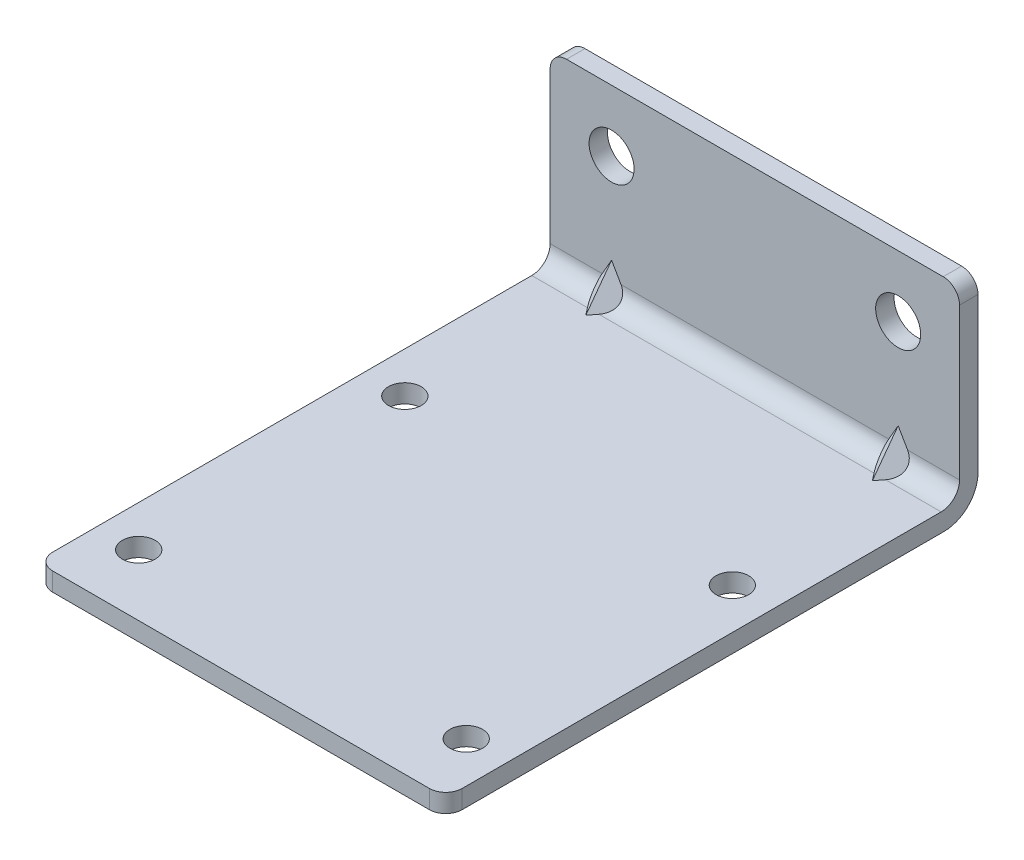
ISO-10303-21;
HEADER;
FILE_DESCRIPTION(('STEP AP214'),'2;1');
FILE_NAME('part.step','',(''),(''),'','','');
FILE_SCHEMA(('AUTOMOTIVE_DESIGN { 1 0 10303 214 1 1 1 1 }'));
ENDSEC;
DATA;
#1=APPLICATION_CONTEXT('core data for automotive mechanical design processes');
#2=APPLICATION_PROTOCOL_DEFINITION('international standard','automotive_design',2000,#1);
#3=PRODUCT_CONTEXT('',#1,'mechanical');
#4=PRODUCT('Part','Part','',(#3));
#5=PRODUCT_RELATED_PRODUCT_CATEGORY('part','',(#4));
#6=PRODUCT_DEFINITION_FORMATION('','',#4);
#7=PRODUCT_DEFINITION_CONTEXT('part definition',#1,'design');
#8=PRODUCT_DEFINITION('design','',#6,#7);
#9=PRODUCT_DEFINITION_SHAPE('','',#8);
#10=(LENGTH_UNIT() NAMED_UNIT(*) SI_UNIT(.MILLI.,.METRE.));
#11=(NAMED_UNIT(*) PLANE_ANGLE_UNIT() SI_UNIT($,.RADIAN.));
#12=(NAMED_UNIT(*) SI_UNIT($,.STERADIAN.) SOLID_ANGLE_UNIT());
#13=UNCERTAINTY_MEASURE_WITH_UNIT(LENGTH_MEASURE(1.E-05),#10,'distance_accuracy_value','');
#14=(GEOMETRIC_REPRESENTATION_CONTEXT(3) GLOBAL_UNCERTAINTY_ASSIGNED_CONTEXT((#13)) GLOBAL_UNIT_ASSIGNED_CONTEXT((#10,
#11,#12)) REPRESENTATION_CONTEXT('',''));
#15=CARTESIAN_POINT('',(0.,0.,0.));
#16=DIRECTION('',(0.,0.,1.));
#17=DIRECTION('',(1.,0.,0.));
#18=AXIS2_PLACEMENT_3D('',#15,#16,#17);
#19=CARTESIAN_POINT('',(-15.,-35.,130.));
#20=DIRECTION('',(0.,-1.,0.));
#21=DIRECTION('',(0.,0.,1.));
#22=AXIS2_PLACEMENT_3D('',#19,#20,#21);
#23=PLANE('',#22);
#24=CARTESIAN_POINT('',(75.,-35.,50.));
#25=DIRECTION('',(0.,-1.,0.));
#26=DIRECTION('',(1.,0.,0.));
#27=AXIS2_PLACEMENT_3D('',#24,#25,#26);
#28=CIRCLE('',#27,4.);
#29=CARTESIAN_POINT('',(79.,-35.,50.));
#30=VERTEX_POINT('',#29);
#31=EDGE_CURVE('E254',#30,#30,#28,.T.);
#32=ORIENTED_EDGE('',*,*,#31,.F.);
#33=EDGE_LOOP('',(#32));
#34=FACE_BOUND('',#33,.T.);
#35=CARTESIAN_POINT('',(-5.,-35.,50.));
#36=DIRECTION('',(0.,1.,0.));
#37=DIRECTION('',(-1.,0.,0.));
#38=AXIS2_PLACEMENT_3D('',#35,#36,#37);
#39=CIRCLE('',#38,4.);
#40=CARTESIAN_POINT('',(-9.,-35.,50.));
#41=VERTEX_POINT('',#40);
#42=EDGE_CURVE('E260',#41,#41,#39,.T.);
#43=ORIENTED_EDGE('',*,*,#42,.T.);
#44=EDGE_LOOP('',(#43));
#45=FACE_BOUND('',#44,.T.);
#46=CARTESIAN_POINT('',(-5.,-35.,115.));
#47=DIRECTION('',(0.,1.,0.));
#48=DIRECTION('',(-1.,0.,0.));
#49=AXIS2_PLACEMENT_3D('',#46,#47,#48);
#50=CIRCLE('',#49,4.);
#51=CARTESIAN_POINT('',(-9.,-35.,115.));
#52=VERTEX_POINT('',#51);
#53=EDGE_CURVE('E266',#52,#52,#50,.T.);
#54=ORIENTED_EDGE('',*,*,#53,.T.);
#55=EDGE_LOOP('',(#54));
#56=FACE_BOUND('',#55,.T.);
#57=CARTESIAN_POINT('',(75.,-35.,115.));
#58=DIRECTION('',(0.,-1.,0.));
#59=DIRECTION('',(1.,0.,0.));
#60=AXIS2_PLACEMENT_3D('',#57,#58,#59);
#61=CIRCLE('',#60,4.);
#62=CARTESIAN_POINT('',(79.,-35.,115.));
#63=VERTEX_POINT('',#62);
#64=EDGE_CURVE('E248',#63,#63,#61,.T.);
#65=ORIENTED_EDGE('',*,*,#64,.F.);
#66=EDGE_LOOP('',(#65));
#67=FACE_BOUND('',#66,.T.);
#68=DIRECTION('',(-0.614470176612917,0.,0.788940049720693));
#69=VECTOR('',#68,1.);
#70=CARTESIAN_POINT('',(-64.6392494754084,-35.,91.3382050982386));
#71=LINE('',#70,#69);
#72=CARTESIAN_POINT('',(0.035500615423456,-35.,8.3));
#73=VERTEX_POINT('',#72);
#74=CARTESIAN_POINT('',(0.,-35.,8.34558049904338));
#75=VERTEX_POINT('',#74);
#76=EDGE_CURVE('E212',#73,#75,#71,.T.);
#77=ORIENTED_EDGE('',*,*,#76,.F.);
#78=DIRECTION('',(1.,0.,0.));
#79=VECTOR('',#78,1.);
#80=CARTESIAN_POINT('',(-15.,-35.,8.3));
#81=LINE('',#80,#79);
#82=CARTESIAN_POINT('',(69.9644993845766,-35.,8.3));
#83=VERTEX_POINT('',#82);
#84=EDGE_CURVE('E193',#73,#83,#81,.T.);
#85=ORIENTED_EDGE('',*,*,#84,.T.);
#86=DIRECTION('',(-0.614470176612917,0.,-0.788940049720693));
#87=VECTOR('',#86,1.);
#88=CARTESIAN_POINT('',(96.8818896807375,-35.,42.8601919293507));
#89=LINE('',#88,#87);
#90=CARTESIAN_POINT('',(70.,-35.,8.34558049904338));
#91=VERTEX_POINT('',#90);
#92=EDGE_CURVE('E187',#83,#91,#89,.F.);
#93=ORIENTED_EDGE('',*,*,#92,.T.);
#94=DIRECTION('',(-0.614470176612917,0.,0.788940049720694));
#95=VECTOR('',#94,1.);
#96=CARTESIAN_POINT('',(-21.0694013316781,-35.,125.27281431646));
#97=LINE('',#96,#95);
#98=CARTESIAN_POINT('',(70.0355006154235,-35.,8.3));
#99=VERTEX_POINT('',#98);
#100=EDGE_CURVE('E175',#99,#91,#97,.T.);
#101=ORIENTED_EDGE('',*,*,#100,.F.);
#102=DIRECTION('',(1.,0.,0.));
#103=VECTOR('',#102,1.);
#104=CARTESIAN_POINT('',(-15.,-35.,8.3));
#105=LINE('',#104,#103);
#106=CARTESIAN_POINT('',(85.,-35.,8.3));
#107=VERTEX_POINT('',#106);
#108=EDGE_CURVE('E381',#99,#107,#105,.T.);
#109=ORIENTED_EDGE('',*,*,#108,.T.);
#110=DIRECTION('',(0.,0.,-1.));
#111=VECTOR('',#110,1.);
#112=CARTESIAN_POINT('',(85.,-35.,130.));
#113=LINE('',#112,#111);
#114=CARTESIAN_POINT('',(85.,-35.,126.));
#115=VERTEX_POINT('',#114);
#116=EDGE_CURVE('E283',#115,#107,#113,.T.);
#117=ORIENTED_EDGE('',*,*,#116,.F.);
#118=CARTESIAN_POINT('',(81.,-35.,126.));
#119=DIRECTION('',(0.,-1.,0.));
#120=DIRECTION('',(0.,0.,1.));
#121=AXIS2_PLACEMENT_3D('',#118,#119,#120);
#122=CIRCLE('',#121,4.);
#123=CARTESIAN_POINT('',(81.,-35.,130.));
#124=VERTEX_POINT('',#123);
#125=EDGE_CURVE('E338',#115,#124,#122,.T.);
#126=ORIENTED_EDGE('',*,*,#125,.T.);
#127=DIRECTION('',(1.,0.,0.));
#128=VECTOR('',#127,1.);
#129=CARTESIAN_POINT('',(-15.,-35.,130.));
#130=LINE('',#129,#128);
#131=CARTESIAN_POINT('',(-11.,-35.,130.));
#132=VERTEX_POINT('',#131);
#133=EDGE_CURVE('E306',#132,#124,#130,.T.);
#134=ORIENTED_EDGE('',*,*,#133,.F.);
#135=CARTESIAN_POINT('',(-11.,-35.,126.));
#136=DIRECTION('',(0.,-1.,0.));
#137=DIRECTION('',(0.,0.,1.));
#138=AXIS2_PLACEMENT_3D('',#135,#136,#137);
#139=CIRCLE('',#138,4.);
#140=CARTESIAN_POINT('',(-15.,-35.,126.));
#141=VERTEX_POINT('',#140);
#142=EDGE_CURVE('E336',#132,#141,#139,.T.);
#143=ORIENTED_EDGE('',*,*,#142,.T.);
#144=DIRECTION('',(0.,0.,-1.));
#145=VECTOR('',#144,1.);
#146=CARTESIAN_POINT('',(-15.,-35.,130.));
#147=LINE('',#146,#145);
#148=CARTESIAN_POINT('',(-15.,-35.,8.3));
#149=VERTEX_POINT('',#148);
#150=EDGE_CURVE('E292',#141,#149,#147,.T.);
#151=ORIENTED_EDGE('',*,*,#150,.T.);
#152=DIRECTION('',(1.,0.,0.));
#153=VECTOR('',#152,1.);
#154=CARTESIAN_POINT('',(-15.,-35.,8.3));
#155=LINE('',#154,#153);
#156=CARTESIAN_POINT('',(-0.0355006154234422,-35.,8.3));
#157=VERTEX_POINT('',#156);
#158=EDGE_CURVE('E378',#149,#157,#155,.T.);
#159=ORIENTED_EDGE('',*,*,#158,.T.);
#160=DIRECTION('',(-0.614470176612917,0.,-0.788940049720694));
#161=VECTOR('',#160,1.);
#162=CARTESIAN_POINT('',(53.3120415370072,-35.,76.7948011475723));
#163=LINE('',#162,#161);
#164=EDGE_CURVE('E214',#157,#75,#163,.F.);
#165=ORIENTED_EDGE('',*,*,#164,.T.);
#166=EDGE_LOOP('',(#77,#85,#93,#101,#109,#117,#126,#134,#143,#151,#159,#165));
#167=FACE_BOUND('',#166,.T.);
#168=ADVANCED_FACE('F14',(#34,#45,#56,#67,#167),#23,.T.);
#169=CARTESIAN_POINT('',(-15.,-35.,0.));
#170=DIRECTION('',(0.,0.,-1.));
#171=DIRECTION('',(0.,-1.,0.));
#172=AXIS2_PLACEMENT_3D('',#169,#170,#171);
#173=PLANE('',#172);
#174=CARTESIAN_POINT('',(70.,0.,0.));
#175=DIRECTION('',(0.,0.,1.));
#176=DIRECTION('',(0.,1.,0.));
#177=AXIS2_PLACEMENT_3D('',#174,#175,#176);
#178=CIRCLE('',#177,5.5);
#179=CARTESIAN_POINT('',(70.,5.5,0.));
#180=VERTEX_POINT('',#179);
#181=EDGE_CURVE('E278',#180,#180,#178,.T.);
#182=ORIENTED_EDGE('',*,*,#181,.T.);
#183=EDGE_LOOP('',(#182));
#184=FACE_BOUND('',#183,.T.);
#185=CARTESIAN_POINT('',(0.,0.,0.));
#186=DIRECTION('',(0.,0.,-1.));
#187=DIRECTION('',(0.,-1.,0.));
#188=AXIS2_PLACEMENT_3D('',#185,#186,#187);
#189=CIRCLE('',#188,5.5);
#190=CARTESIAN_POINT('',(0.,-5.5,0.));
#191=VERTEX_POINT('',#190);
#192=EDGE_CURVE('E272',#191,#191,#189,.T.);
#193=ORIENTED_EDGE('',*,*,#192,.F.);
#194=EDGE_LOOP('',(#193));
#195=FACE_BOUND('',#194,.T.);
#196=DIRECTION('',(-0.5,-0.866025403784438,0.));
#197=VECTOR('',#196,1.);
#198=CARTESIAN_POINT('',(70.,-23.7416697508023,0.));
#199=LINE('',#198,#197);
#200=CARTESIAN_POINT('',(70.,-23.7416697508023,0.));
#201=VERTEX_POINT('',#200);
#202=CARTESIAN_POINT('',(68.2920072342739,-26.7,0.));
#203=VERTEX_POINT('',#202);
#204=EDGE_CURVE('E199',#201,#203,#199,.T.);
#205=ORIENTED_EDGE('',*,*,#204,.T.);
#206=DIRECTION('',(1.,0.,0.));
#207=VECTOR('',#206,1.);
#208=CARTESIAN_POINT('',(-15.,-26.7,0.));
#209=LINE('',#208,#207);
#210=CARTESIAN_POINT('',(1.7079927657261,-26.7,0.));
#211=VERTEX_POINT('',#210);
#212=EDGE_CURVE('E389',#203,#211,#209,.F.);
#213=ORIENTED_EDGE('',*,*,#212,.T.);
#214=DIRECTION('',(0.5,-0.866025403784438,0.));
#215=VECTOR('',#214,1.);
#216=CARTESIAN_POINT('',(0.,-23.7416697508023,0.));
#217=LINE('',#216,#215);
#218=CARTESIAN_POINT('',(0.,-23.7416697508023,0.));
#219=VERTEX_POINT('',#218);
#220=EDGE_CURVE('E206',#219,#211,#217,.T.);
#221=ORIENTED_EDGE('',*,*,#220,.F.);
#222=DIRECTION('',(-0.5,-0.866025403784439,0.));
#223=VECTOR('',#222,1.);
#224=CARTESIAN_POINT('',(0.,-23.7416697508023,0.));
#225=LINE('',#224,#223);
#226=CARTESIAN_POINT('',(-1.70799276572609,-26.7,0.));
#227=VERTEX_POINT('',#226);
#228=EDGE_CURVE('E195',#219,#227,#225,.T.);
#229=ORIENTED_EDGE('',*,*,#228,.T.);
#230=DIRECTION('',(1.,0.,0.));
#231=VECTOR('',#230,1.);
#232=CARTESIAN_POINT('',(-15.,-26.7,0.));
#233=LINE('',#232,#231);
#234=CARTESIAN_POINT('',(-15.,-26.7,0.));
#235=VERTEX_POINT('',#234);
#236=EDGE_CURVE('E37',#227,#235,#233,.F.);
#237=ORIENTED_EDGE('',*,*,#236,.T.);
#238=DIRECTION('',(0.,1.,0.));
#239=VECTOR('',#238,1.);
#240=CARTESIAN_POINT('',(-15.,-35.,0.));
#241=LINE('',#240,#239);
#242=CARTESIAN_POINT('',(-15.,11.,0.));
#243=VERTEX_POINT('',#242);
#244=EDGE_CURVE('E290',#235,#243,#241,.T.);
#245=ORIENTED_EDGE('',*,*,#244,.T.);
#246=CARTESIAN_POINT('',(-11.,11.,0.));
#247=DIRECTION('',(0.,0.,-1.));
#248=DIRECTION('',(0.,-1.,0.));
#249=AXIS2_PLACEMENT_3D('',#246,#247,#248);
#250=CIRCLE('',#249,4.);
#251=CARTESIAN_POINT('',(-11.,15.,0.));
#252=VERTEX_POINT('',#251);
#253=EDGE_CURVE('E318',#243,#252,#250,.T.);
#254=ORIENTED_EDGE('',*,*,#253,.T.);
#255=DIRECTION('',(1.,0.,0.));
#256=VECTOR('',#255,1.);
#257=CARTESIAN_POINT('',(-15.,15.,0.));
#258=LINE('',#257,#256);
#259=CARTESIAN_POINT('',(81.,15.,0.));
#260=VERTEX_POINT('',#259);
#261=EDGE_CURVE('E309',#252,#260,#258,.T.);
#262=ORIENTED_EDGE('',*,*,#261,.T.);
#263=CARTESIAN_POINT('',(81.,11.,0.));
#264=DIRECTION('',(0.,0.,-1.));
#265=DIRECTION('',(0.,-1.,0.));
#266=AXIS2_PLACEMENT_3D('',#263,#264,#265);
#267=CIRCLE('',#266,4.);
#268=CARTESIAN_POINT('',(85.,11.,0.));
#269=VERTEX_POINT('',#268);
#270=EDGE_CURVE('E315',#260,#269,#267,.T.);
#271=ORIENTED_EDGE('',*,*,#270,.T.);
#272=DIRECTION('',(0.,1.,0.));
#273=VECTOR('',#272,1.);
#274=CARTESIAN_POINT('',(85.,-35.,0.));
#275=LINE('',#274,#273);
#276=CARTESIAN_POINT('',(85.,-26.7,0.));
#277=VERTEX_POINT('',#276);
#278=EDGE_CURVE('E281',#277,#269,#275,.T.);
#279=ORIENTED_EDGE('',*,*,#278,.F.);
#280=DIRECTION('',(1.,0.,0.));
#281=VECTOR('',#280,1.);
#282=CARTESIAN_POINT('',(-15.,-26.7,0.));
#283=LINE('',#282,#281);
#284=CARTESIAN_POINT('',(71.7079927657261,-26.7,0.));
#285=VERTEX_POINT('',#284);
#286=EDGE_CURVE('E387',#277,#285,#283,.F.);
#287=ORIENTED_EDGE('',*,*,#286,.T.);
#288=DIRECTION('',(0.5,-0.866025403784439,0.));
#289=VECTOR('',#288,1.);
#290=CARTESIAN_POINT('',(70.,-23.7416697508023,0.));
#291=LINE('',#290,#289);
#292=EDGE_CURVE('E200',#201,#285,#291,.T.);
#293=ORIENTED_EDGE('',*,*,#292,.F.);
#294=EDGE_LOOP('',(#205,#213,#221,#229,#237,#245,#254,#262,#271,#279,#287,#293));
#295=FACE_BOUND('',#294,.T.);
#296=ADVANCED_FACE('F16',(#184,#195,#295),#173,.T.);
#297=CARTESIAN_POINT('',(-15.,-30.5,130.));
#298=DIRECTION('',(0.,-1.,0.));
#299=DIRECTION('',(0.,0.,1.));
#300=AXIS2_PLACEMENT_3D('',#297,#298,#299);
#301=PLANE('',#300);
#302=CARTESIAN_POINT('',(75.,-30.5,115.));
#303=DIRECTION('',(0.,-1.,0.));
#304=DIRECTION('',(1.,0.,0.));
#305=AXIS2_PLACEMENT_3D('',#302,#303,#304);
#306=CIRCLE('',#305,4.);
#307=CARTESIAN_POINT('',(79.,-30.5,115.));
#308=VERTEX_POINT('',#307);
#309=EDGE_CURVE('E245',#308,#308,#306,.T.);
#310=ORIENTED_EDGE('',*,*,#309,.T.);
#311=EDGE_LOOP('',(#310));
#312=FACE_BOUND('',#311,.T.);
#313=CARTESIAN_POINT('',(-5.,-30.5,115.));
#314=DIRECTION('',(0.,1.,0.));
#315=DIRECTION('',(-1.,0.,0.));
#316=AXIS2_PLACEMENT_3D('',#313,#314,#315);
#317=CIRCLE('',#316,4.);
#318=CARTESIAN_POINT('',(-9.,-30.5,115.));
#319=VERTEX_POINT('',#318);
#320=EDGE_CURVE('E263',#319,#319,#317,.T.);
#321=ORIENTED_EDGE('',*,*,#320,.F.);
#322=EDGE_LOOP('',(#321));
#323=FACE_BOUND('',#322,.T.);
#324=CARTESIAN_POINT('',(-5.,-30.5,50.));
#325=DIRECTION('',(0.,1.,0.));
#326=DIRECTION('',(-1.,0.,0.));
#327=AXIS2_PLACEMENT_3D('',#324,#325,#326);
#328=CIRCLE('',#327,4.);
#329=CARTESIAN_POINT('',(-9.,-30.5,50.));
#330=VERTEX_POINT('',#329);
#331=EDGE_CURVE('E257',#330,#330,#328,.T.);
#332=ORIENTED_EDGE('',*,*,#331,.F.);
#333=EDGE_LOOP('',(#332));
#334=FACE_BOUND('',#333,.T.);
#335=CARTESIAN_POINT('',(75.,-30.5,50.));
#336=DIRECTION('',(0.,-1.,0.));
#337=DIRECTION('',(1.,0.,0.));
#338=AXIS2_PLACEMENT_3D('',#335,#336,#337);
#339=CIRCLE('',#338,4.);
#340=CARTESIAN_POINT('',(79.,-30.5,50.));
#341=VERTEX_POINT('',#340);
#342=EDGE_CURVE('E251',#341,#341,#339,.T.);
#343=ORIENTED_EDGE('',*,*,#342,.T.);
#344=EDGE_LOOP('',(#343));
#345=FACE_BOUND('',#344,.T.);
#346=DIRECTION('',(-0.614470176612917,0.,-0.788940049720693));
#347=VECTOR('',#346,1.);
#348=CARTESIAN_POINT('',(95.6950639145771,-30.5,43.7845575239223));
#349=LINE('',#348,#347);
#350=CARTESIAN_POINT('',(70.,-30.5,10.793753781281));
#351=VERTEX_POINT('',#350);
#352=CARTESIAN_POINT('',(68.6029252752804,-30.5,9.));
#353=VERTEX_POINT('',#352);
#354=EDGE_CURVE('E228',#351,#353,#349,.T.);
#355=ORIENTED_EDGE('',*,*,#354,.T.);
#356=DIRECTION('',(1.,0.,0.));
#357=VECTOR('',#356,1.);
#358=CARTESIAN_POINT('',(-15.,-30.5,9.));
#359=LINE('',#358,#357);
#360=CARTESIAN_POINT('',(1.3970747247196,-30.5,9.));
#361=VERTEX_POINT('',#360);
#362=EDGE_CURVE('E366',#353,#361,#359,.F.);
#363=ORIENTED_EDGE('',*,*,#362,.T.);
#364=DIRECTION('',(-0.614470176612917,0.,0.788940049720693));
#365=VECTOR('',#364,1.);
#366=CARTESIAN_POINT('',(-63.4524237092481,-30.5,92.2625706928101));
#367=LINE('',#366,#365);
#368=CARTESIAN_POINT('',(0.,-30.5,10.793753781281));
#369=VERTEX_POINT('',#368);
#370=EDGE_CURVE('E242',#369,#361,#367,.F.);
#371=ORIENTED_EDGE('',*,*,#370,.F.);
#372=DIRECTION('',(-0.614470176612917,0.,-0.788940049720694));
#373=VECTOR('',#372,1.);
#374=CARTESIAN_POINT('',(52.1252157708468,-30.5,77.7191667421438));
#375=LINE('',#374,#373);
#376=CARTESIAN_POINT('',(-1.39707472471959,-30.5,9.));
#377=VERTEX_POINT('',#376);
#378=EDGE_CURVE('E239',#369,#377,#375,.T.);
#379=ORIENTED_EDGE('',*,*,#378,.T.);
#380=DIRECTION('',(1.,0.,0.));
#381=VECTOR('',#380,1.);
#382=CARTESIAN_POINT('',(-15.,-30.5,9.));
#383=LINE('',#382,#381);
#384=CARTESIAN_POINT('',(-15.,-30.5,9.));
#385=VERTEX_POINT('',#384);
#386=EDGE_CURVE('E362',#377,#385,#383,.F.);
#387=ORIENTED_EDGE('',*,*,#386,.T.);
#388=DIRECTION('',(0.,0.,-1.));
#389=VECTOR('',#388,1.);
#390=CARTESIAN_POINT('',(-15.,-30.5,130.));
#391=LINE('',#390,#389);
#392=CARTESIAN_POINT('',(-15.,-30.5,126.));
#393=VERTEX_POINT('',#392);
#394=EDGE_CURVE('E295',#393,#385,#391,.T.);
#395=ORIENTED_EDGE('',*,*,#394,.F.);
#396=CARTESIAN_POINT('',(-11.,-30.5,126.));
#397=DIRECTION('',(0.,-1.,0.));
#398=DIRECTION('',(0.,0.,1.));
#399=AXIS2_PLACEMENT_3D('',#396,#397,#398);
#400=CIRCLE('',#399,4.);
#401=CARTESIAN_POINT('',(-11.,-30.5,130.));
#402=VERTEX_POINT('',#401);
#403=EDGE_CURVE('E345',#393,#402,#400,.F.);
#404=ORIENTED_EDGE('',*,*,#403,.T.);
#405=DIRECTION('',(1.,0.,0.));
#406=VECTOR('',#405,1.);
#407=CARTESIAN_POINT('',(-15.,-30.5,130.));
#408=LINE('',#407,#406);
#409=CARTESIAN_POINT('',(81.,-30.5,130.));
#410=VERTEX_POINT('',#409);
#411=EDGE_CURVE('E303',#402,#410,#408,.T.);
#412=ORIENTED_EDGE('',*,*,#411,.T.);
#413=CARTESIAN_POINT('',(81.,-30.5,126.));
#414=DIRECTION('',(0.,-1.,0.));
#415=DIRECTION('',(0.,0.,1.));
#416=AXIS2_PLACEMENT_3D('',#413,#414,#415);
#417=CIRCLE('',#416,4.);
#418=CARTESIAN_POINT('',(85.,-30.5,126.));
#419=VERTEX_POINT('',#418);
#420=EDGE_CURVE('E347',#410,#419,#417,.F.);
#421=ORIENTED_EDGE('',*,*,#420,.T.);
#422=DIRECTION('',(0.,0.,-1.));
#423=VECTOR('',#422,1.);
#424=CARTESIAN_POINT('',(85.,-30.5,130.));
#425=LINE('',#424,#423);
#426=CARTESIAN_POINT('',(85.,-30.5,9.));
#427=VERTEX_POINT('',#426);
#428=EDGE_CURVE('E285',#419,#427,#425,.T.);
#429=ORIENTED_EDGE('',*,*,#428,.T.);
#430=DIRECTION('',(1.,0.,0.));
#431=VECTOR('',#430,1.);
#432=CARTESIAN_POINT('',(-15.,-30.5,9.));
#433=LINE('',#432,#431);
#434=CARTESIAN_POINT('',(71.3970747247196,-30.5,9.));
#435=VERTEX_POINT('',#434);
#436=EDGE_CURVE('E364',#427,#435,#433,.F.);
#437=ORIENTED_EDGE('',*,*,#436,.T.);
#438=DIRECTION('',(-0.614470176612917,0.,0.788940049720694));
#439=VECTOR('',#438,1.);
#440=CARTESIAN_POINT('',(-19.8825755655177,-30.5,126.197179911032));
#441=LINE('',#440,#439);
#442=EDGE_CURVE('E225',#351,#435,#441,.F.);
#443=ORIENTED_EDGE('',*,*,#442,.F.);
#444=EDGE_LOOP('',(#355,#363,#371,#379,#387,#395,#404,#412,#421,#429,#437,#443));
#445=FACE_BOUND('',#444,.T.);
#446=ADVANCED_FACE('F418',(#312,#323,#334,#345,#445),#301,.F.);
#447=CARTESIAN_POINT('',(-15.,-35.,4.5));
#448=DIRECTION('',(0.,0.,-1.));
#449=DIRECTION('',(0.,-1.,0.));
#450=AXIS2_PLACEMENT_3D('',#447,#448,#449);
#451=PLANE('',#450);
#452=CARTESIAN_POINT('',(0.,0.,4.5));
#453=DIRECTION('',(0.,0.,-1.));
#454=DIRECTION('',(0.,-1.,0.));
#455=AXIS2_PLACEMENT_3D('',#452,#453,#454);
#456=CIRCLE('',#455,5.5);
#457=CARTESIAN_POINT('',(0.,-5.5,4.5));
#458=VERTEX_POINT('',#457);
#459=EDGE_CURVE('E269',#458,#458,#456,.T.);
#460=ORIENTED_EDGE('',*,*,#459,.T.);
#461=EDGE_LOOP('',(#460));
#462=FACE_BOUND('',#461,.T.);
#463=CARTESIAN_POINT('',(70.,0.,4.5));
#464=DIRECTION('',(0.,0.,1.));
#465=DIRECTION('',(0.,1.,0.));
#466=AXIS2_PLACEMENT_3D('',#463,#464,#465);
#467=CIRCLE('',#466,5.5);
#468=CARTESIAN_POINT('',(70.,5.5,4.5));
#469=VERTEX_POINT('',#468);
#470=EDGE_CURVE('E275',#469,#469,#467,.T.);
#471=ORIENTED_EDGE('',*,*,#470,.F.);
#472=EDGE_LOOP('',(#471));
#473=FACE_BOUND('',#472,.T.);
#474=DIRECTION('',(-0.5,0.866025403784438,0.));
#475=VECTOR('',#474,1.);
#476=CARTESIAN_POINT('',(7.5,-35.,4.5));
#477=LINE('',#476,#475);
#478=CARTESIAN_POINT('',(2.30384757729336,-26.,4.5));
#479=VERTEX_POINT('',#478);
#480=CARTESIAN_POINT('',(0.,-22.0096189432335,4.5));
#481=VERTEX_POINT('',#480);
#482=EDGE_CURVE('E231',#479,#481,#477,.T.);
#483=ORIENTED_EDGE('',*,*,#482,.F.);
#484=DIRECTION('',(1.,0.,0.));
#485=VECTOR('',#484,1.);
#486=CARTESIAN_POINT('',(-15.,-26.,4.5));
#487=LINE('',#486,#485);
#488=CARTESIAN_POINT('',(67.6961524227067,-26.,4.5));
#489=VERTEX_POINT('',#488);
#490=EDGE_CURVE('E357',#479,#489,#487,.T.);
#491=ORIENTED_EDGE('',*,*,#490,.T.);
#492=DIRECTION('',(0.5,0.866025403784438,0.));
#493=VECTOR('',#492,1.);
#494=CARTESIAN_POINT('',(62.5,-35.,4.5));
#495=LINE('',#494,#493);
#496=CARTESIAN_POINT('',(70.,-22.0096189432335,4.5));
#497=VERTEX_POINT('',#496);
#498=EDGE_CURVE('E217',#489,#497,#495,.T.);
#499=ORIENTED_EDGE('',*,*,#498,.T.);
#500=DIRECTION('',(-0.5,0.866025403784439,0.));
#501=VECTOR('',#500,1.);
#502=CARTESIAN_POINT('',(77.5,-35.,4.5));
#503=LINE('',#502,#501);
#504=CARTESIAN_POINT('',(72.3038475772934,-26.,4.5));
#505=VERTEX_POINT('',#504);
#506=EDGE_CURVE('E220',#505,#497,#503,.T.);
#507=ORIENTED_EDGE('',*,*,#506,.F.);
#508=DIRECTION('',(1.,0.,0.));
#509=VECTOR('',#508,1.);
#510=CARTESIAN_POINT('',(-15.,-26.,4.5));
#511=LINE('',#510,#509);
#512=CARTESIAN_POINT('',(85.,-26.,4.5));
#513=VERTEX_POINT('',#512);
#514=EDGE_CURVE('E354',#505,#513,#511,.T.);
#515=ORIENTED_EDGE('',*,*,#514,.T.);
#516=DIRECTION('',(0.,1.,0.));
#517=VECTOR('',#516,1.);
#518=CARTESIAN_POINT('',(85.,-35.,4.5));
#519=LINE('',#518,#517);
#520=CARTESIAN_POINT('',(85.,11.,4.5));
#521=VERTEX_POINT('',#520);
#522=EDGE_CURVE('E288',#513,#521,#519,.T.);
#523=ORIENTED_EDGE('',*,*,#522,.T.);
#524=CARTESIAN_POINT('',(81.,11.,4.5));
#525=DIRECTION('',(0.,0.,-1.));
#526=DIRECTION('',(0.,-1.,0.));
#527=AXIS2_PLACEMENT_3D('',#524,#525,#526);
#528=CIRCLE('',#527,4.);
#529=CARTESIAN_POINT('',(81.,15.,4.5));
#530=VERTEX_POINT('',#529);
#531=EDGE_CURVE('E325',#521,#530,#528,.F.);
#532=ORIENTED_EDGE('',*,*,#531,.T.);
#533=DIRECTION('',(1.,0.,0.));
#534=VECTOR('',#533,1.);
#535=CARTESIAN_POINT('',(-15.,15.,4.5));
#536=LINE('',#535,#534);
#537=CARTESIAN_POINT('',(-11.,15.,4.5));
#538=VERTEX_POINT('',#537);
#539=EDGE_CURVE('E300',#538,#530,#536,.T.);
#540=ORIENTED_EDGE('',*,*,#539,.F.);
#541=CARTESIAN_POINT('',(-11.,11.,4.5));
#542=DIRECTION('',(0.,0.,-1.));
#543=DIRECTION('',(0.,-1.,0.));
#544=AXIS2_PLACEMENT_3D('',#541,#542,#543);
#545=CIRCLE('',#544,4.);
#546=CARTESIAN_POINT('',(-15.,11.,4.5));
#547=VERTEX_POINT('',#546);
#548=EDGE_CURVE('E327',#538,#547,#545,.F.);
#549=ORIENTED_EDGE('',*,*,#548,.T.);
#550=DIRECTION('',(0.,1.,0.));
#551=VECTOR('',#550,1.);
#552=CARTESIAN_POINT('',(-15.,-35.,4.5));
#553=LINE('',#552,#551);
#554=CARTESIAN_POINT('',(-15.,-26.,4.5));
#555=VERTEX_POINT('',#554);
#556=EDGE_CURVE('E298',#555,#547,#553,.T.);
#557=ORIENTED_EDGE('',*,*,#556,.F.);
#558=DIRECTION('',(1.,0.,0.));
#559=VECTOR('',#558,1.);
#560=CARTESIAN_POINT('',(-15.,-26.,4.5));
#561=LINE('',#560,#559);
#562=CARTESIAN_POINT('',(-2.30384757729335,-26.,4.5));
#563=VERTEX_POINT('',#562);
#564=EDGE_CURVE('E351',#555,#563,#561,.T.);
#565=ORIENTED_EDGE('',*,*,#564,.T.);
#566=DIRECTION('',(0.5,0.866025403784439,0.));
#567=VECTOR('',#566,1.);
#568=CARTESIAN_POINT('',(-7.5,-35.,4.5));
#569=LINE('',#568,#567);
#570=EDGE_CURVE('E233',#563,#481,#569,.T.);
#571=ORIENTED_EDGE('',*,*,#570,.T.);
#572=EDGE_LOOP('',(#483,#491,#499,#507,#515,#523,#532,#540,#549,#557,#565,#571));
#573=FACE_BOUND('',#572,.T.);
#574=ADVANCED_FACE('F438',(#462,#473,#573),#451,.F.);
#575=CARTESIAN_POINT('',(-15.,15.,4.5));
#576=DIRECTION('',(0.,-1.,0.));
#577=DIRECTION('',(1.,0.,0.));
#578=AXIS2_PLACEMENT_3D('',#575,#576,#577);
#579=PLANE('',#578);
#580=ORIENTED_EDGE('',*,*,#261,.F.);
#581=DIRECTION('',(0.,0.,-1.));
#582=VECTOR('',#581,1.);
#583=CARTESIAN_POINT('',(-11.,15.,130.));
#584=LINE('',#583,#582);
#585=EDGE_CURVE('E323',#252,#538,#584,.F.);
#586=ORIENTED_EDGE('',*,*,#585,.T.);
#587=ORIENTED_EDGE('',*,*,#539,.T.);
#588=DIRECTION('',(0.,0.,-1.));
#589=VECTOR('',#588,1.);
#590=CARTESIAN_POINT('',(81.,15.,4.5));
#591=LINE('',#590,#589);
#592=EDGE_CURVE('E320',#530,#260,#591,.T.);
#593=ORIENTED_EDGE('',*,*,#592,.T.);
#594=EDGE_LOOP('',(#580,#586,#587,#593));
#595=FACE_BOUND('',#594,.T.);
#596=ADVANCED_FACE('F442',(#595),#579,.F.);
#597=CARTESIAN_POINT('',(-15.,-30.5,130.));
#598=DIRECTION('',(0.,0.,1.));
#599=DIRECTION('',(0.,1.,0.));
#600=AXIS2_PLACEMENT_3D('',#597,#598,#599);
#601=PLANE('',#600);
#602=ORIENTED_EDGE('',*,*,#133,.T.);
#603=DIRECTION('',(0.,-1.,0.));
#604=VECTOR('',#603,1.);
#605=CARTESIAN_POINT('',(81.,15.,130.));
#606=LINE('',#605,#604);
#607=EDGE_CURVE('E343',#124,#410,#606,.F.);
#608=ORIENTED_EDGE('',*,*,#607,.T.);
#609=ORIENTED_EDGE('',*,*,#411,.F.);
#610=DIRECTION('',(0.,-1.,0.));
#611=VECTOR('',#610,1.);
#612=CARTESIAN_POINT('',(-11.,-30.5,130.));
#613=LINE('',#612,#611);
#614=EDGE_CURVE('E340',#402,#132,#613,.T.);
#615=ORIENTED_EDGE('',*,*,#614,.T.);
#616=EDGE_LOOP('',(#602,#608,#609,#615));
#617=FACE_BOUND('',#616,.T.);
#618=ADVANCED_FACE('F414',(#617),#601,.T.);
#619=CARTESIAN_POINT('',(-15.,15.,130.));
#620=DIRECTION('',(-1.,0.,0.));
#621=DIRECTION('',(0.,-1.,0.));
#622=AXIS2_PLACEMENT_3D('',#619,#620,#621);
#623=PLANE('',#622);
#624=ORIENTED_EDGE('',*,*,#244,.F.);
#625=CARTESIAN_POINT('',(-15.,-26.7,8.3));
#626=DIRECTION('',(-1.,0.,0.));
#627=DIRECTION('',(0.,-1.,0.));
#628=AXIS2_PLACEMENT_3D('',#625,#626,#627);
#629=CIRCLE('',#628,8.3);
#630=EDGE_CURVE('E9',#235,#149,#629,.T.);
#631=ORIENTED_EDGE('',*,*,#630,.T.);
#632=ORIENTED_EDGE('',*,*,#150,.F.);
#633=DIRECTION('',(0.,-1.,0.));
#634=VECTOR('',#633,1.);
#635=CARTESIAN_POINT('',(-15.,15.,126.));
#636=LINE('',#635,#634);
#637=EDGE_CURVE('E349',#141,#393,#636,.F.);
#638=ORIENTED_EDGE('',*,*,#637,.T.);
#639=ORIENTED_EDGE('',*,*,#394,.T.);
#640=CARTESIAN_POINT('',(-15.,-26.,9.));
#641=DIRECTION('',(-1.,0.,0.));
#642=DIRECTION('',(0.,-1.,0.));
#643=AXIS2_PLACEMENT_3D('',#640,#641,#642);
#644=CIRCLE('',#643,4.5);
#645=EDGE_CURVE('E376',#385,#555,#644,.F.);
#646=ORIENTED_EDGE('',*,*,#645,.T.);
#647=ORIENTED_EDGE('',*,*,#556,.T.);
#648=DIRECTION('',(0.,0.,-1.));
#649=VECTOR('',#648,1.);
#650=CARTESIAN_POINT('',(-15.,11.,130.));
#651=LINE('',#650,#649);
#652=EDGE_CURVE('E312',#547,#243,#651,.T.);
#653=ORIENTED_EDGE('',*,*,#652,.T.);
#654=EDGE_LOOP('',(#624,#631,#632,#638,#639,#646,#647,#653));
#655=FACE_BOUND('',#654,.T.);
#656=ADVANCED_FACE('F405',(#655),#623,.T.);
#657=CARTESIAN_POINT('',(85.,15.,130.));
#658=DIRECTION('',(-1.,0.,0.));
#659=DIRECTION('',(0.,-1.,0.));
#660=AXIS2_PLACEMENT_3D('',#657,#658,#659);
#661=PLANE('',#660);
#662=ORIENTED_EDGE('',*,*,#116,.T.);
#663=CARTESIAN_POINT('',(85.,-26.7,8.3));
#664=DIRECTION('',(-1.,0.,0.));
#665=DIRECTION('',(0.,-1.,0.));
#666=AXIS2_PLACEMENT_3D('',#663,#664,#665);
#667=CIRCLE('',#666,8.3);
#668=EDGE_CURVE('E29',#107,#277,#667,.F.);
#669=ORIENTED_EDGE('',*,*,#668,.T.);
#670=ORIENTED_EDGE('',*,*,#278,.T.);
#671=DIRECTION('',(0.,0.,-1.));
#672=VECTOR('',#671,1.);
#673=CARTESIAN_POINT('',(85.,11.,130.));
#674=LINE('',#673,#672);
#675=EDGE_CURVE('E330',#269,#521,#674,.F.);
#676=ORIENTED_EDGE('',*,*,#675,.T.);
#677=ORIENTED_EDGE('',*,*,#522,.F.);
#678=CARTESIAN_POINT('',(85.,-26.,9.));
#679=DIRECTION('',(-1.,0.,0.));
#680=DIRECTION('',(0.,-1.,0.));
#681=AXIS2_PLACEMENT_3D('',#678,#679,#680);
#682=CIRCLE('',#681,4.5);
#683=EDGE_CURVE('E374',#513,#427,#682,.T.);
#684=ORIENTED_EDGE('',*,*,#683,.T.);
#685=ORIENTED_EDGE('',*,*,#428,.F.);
#686=DIRECTION('',(0.,-1.,0.));
#687=VECTOR('',#686,1.);
#688=CARTESIAN_POINT('',(85.,15.,126.));
#689=LINE('',#688,#687);
#690=EDGE_CURVE('E333',#419,#115,#689,.T.);
#691=ORIENTED_EDGE('',*,*,#690,.T.);
#692=EDGE_LOOP('',(#662,#669,#670,#676,#677,#684,#685,#691));
#693=FACE_BOUND('',#692,.T.);
#694=ADVANCED_FACE('F425',(#693),#661,.F.);
#695=CARTESIAN_POINT('',(-11.,11.,130.));
#696=DIRECTION('',(0.,0.,1.));
#697=DIRECTION('',(0.,1.,0.));
#698=AXIS2_PLACEMENT_3D('',#695,#696,#697);
#699=CYLINDRICAL_SURFACE('',#698,4.);
#700=ORIENTED_EDGE('',*,*,#548,.F.);
#701=ORIENTED_EDGE('',*,*,#585,.F.);
#702=ORIENTED_EDGE('',*,*,#253,.F.);
#703=ORIENTED_EDGE('',*,*,#652,.F.);
#704=EDGE_LOOP('',(#700,#701,#702,#703));
#705=FACE_BOUND('',#704,.T.);
#706=ADVANCED_FACE('F446',(#705),#699,.T.);
#707=CARTESIAN_POINT('',(81.,11.,4.5));
#708=DIRECTION('',(0.,0.,-1.));
#709=DIRECTION('',(0.,-1.,0.));
#710=AXIS2_PLACEMENT_3D('',#707,#708,#709);
#711=CYLINDRICAL_SURFACE('',#710,4.);
#712=ORIENTED_EDGE('',*,*,#531,.F.);
#713=ORIENTED_EDGE('',*,*,#675,.F.);
#714=ORIENTED_EDGE('',*,*,#270,.F.);
#715=ORIENTED_EDGE('',*,*,#592,.F.);
#716=EDGE_LOOP('',(#712,#713,#714,#715));
#717=FACE_BOUND('',#716,.T.);
#718=ADVANCED_FACE('F434',(#717),#711,.T.);
#719=CARTESIAN_POINT('',(81.,15.,126.));
#720=DIRECTION('',(0.,1.,0.));
#721=DIRECTION('',(-1.,0.,0.));
#722=AXIS2_PLACEMENT_3D('',#719,#720,#721);
#723=CYLINDRICAL_SURFACE('',#722,4.);
#724=ORIENTED_EDGE('',*,*,#420,.F.);
#725=ORIENTED_EDGE('',*,*,#607,.F.);
#726=ORIENTED_EDGE('',*,*,#125,.F.);
#727=ORIENTED_EDGE('',*,*,#690,.F.);
#728=EDGE_LOOP('',(#724,#725,#726,#727));
#729=FACE_BOUND('',#728,.T.);
#730=ADVANCED_FACE('F423',(#729),#723,.T.);
#731=CARTESIAN_POINT('',(-11.,-30.5,126.));
#732=DIRECTION('',(0.,-1.,0.));
#733=DIRECTION('',(1.,0.,0.));
#734=AXIS2_PLACEMENT_3D('',#731,#732,#733);
#735=CYLINDRICAL_SURFACE('',#734,4.);
#736=ORIENTED_EDGE('',*,*,#403,.F.);
#737=ORIENTED_EDGE('',*,*,#637,.F.);
#738=ORIENTED_EDGE('',*,*,#142,.F.);
#739=ORIENTED_EDGE('',*,*,#614,.F.);
#740=EDGE_LOOP('',(#736,#737,#738,#739));
#741=FACE_BOUND('',#740,.T.);
#742=ADVANCED_FACE('F411',(#741),#735,.T.);
#743=CARTESIAN_POINT('',(70.,0.,0.));
#744=DIRECTION('',(0.,0.,1.));
#745=DIRECTION('',(0.,1.,0.));
#746=AXIS2_PLACEMENT_3D('',#743,#744,#745);
#747=CYLINDRICAL_SURFACE('',#746,5.5);
#748=ORIENTED_EDGE('',*,*,#181,.F.);
#749=EDGE_LOOP('',(#748));
#750=FACE_BOUND('',#749,.T.);
#751=ORIENTED_EDGE('',*,*,#470,.T.);
#752=EDGE_LOOP('',(#751));
#753=FACE_BOUND('',#752,.T.);
#754=ADVANCED_FACE('F519',(#750,#753),#747,.F.);
#755=CARTESIAN_POINT('',(0.,0.,0.));
#756=DIRECTION('',(0.,0.,1.));
#757=DIRECTION('',(0.,1.,0.));
#758=AXIS2_PLACEMENT_3D('',#755,#756,#757);
#759=CYLINDRICAL_SURFACE('',#758,5.5);
#760=ORIENTED_EDGE('',*,*,#192,.T.);
#761=EDGE_LOOP('',(#760));
#762=FACE_BOUND('',#761,.T.);
#763=ORIENTED_EDGE('',*,*,#459,.F.);
#764=EDGE_LOOP('',(#763));
#765=FACE_BOUND('',#764,.T.);
#766=ADVANCED_FACE('F522',(#762,#765),#759,.F.);
#767=CARTESIAN_POINT('',(-5.,-35.,115.));
#768=DIRECTION('',(0.,1.,0.));
#769=DIRECTION('',(-1.,0.,0.));
#770=AXIS2_PLACEMENT_3D('',#767,#768,#769);
#771=CYLINDRICAL_SURFACE('',#770,4.);
#772=ORIENTED_EDGE('',*,*,#53,.F.);
#773=EDGE_LOOP('',(#772));
#774=FACE_BOUND('',#773,.T.);
#775=ORIENTED_EDGE('',*,*,#320,.T.);
#776=EDGE_LOOP('',(#775));
#777=FACE_BOUND('',#776,.T.);
#778=ADVANCED_FACE('F526',(#774,#777),#771,.F.);
#779=CARTESIAN_POINT('',(-5.,-35.,50.));
#780=DIRECTION('',(0.,1.,0.));
#781=DIRECTION('',(-1.,0.,0.));
#782=AXIS2_PLACEMENT_3D('',#779,#780,#781);
#783=CYLINDRICAL_SURFACE('',#782,4.);
#784=ORIENTED_EDGE('',*,*,#42,.F.);
#785=EDGE_LOOP('',(#784));
#786=FACE_BOUND('',#785,.T.);
#787=ORIENTED_EDGE('',*,*,#331,.T.);
#788=EDGE_LOOP('',(#787));
#789=FACE_BOUND('',#788,.T.);
#790=ADVANCED_FACE('F530',(#786,#789),#783,.F.);
#791=CARTESIAN_POINT('',(75.,-35.,50.));
#792=DIRECTION('',(0.,1.,0.));
#793=DIRECTION('',(-1.,0.,0.));
#794=AXIS2_PLACEMENT_3D('',#791,#792,#793);
#795=CYLINDRICAL_SURFACE('',#794,4.);
#796=ORIENTED_EDGE('',*,*,#31,.T.);
#797=EDGE_LOOP('',(#796));
#798=FACE_BOUND('',#797,.T.);
#799=ORIENTED_EDGE('',*,*,#342,.F.);
#800=EDGE_LOOP('',(#799));
#801=FACE_BOUND('',#800,.T.);
#802=ADVANCED_FACE('F534',(#798,#801),#795,.F.);
#803=CARTESIAN_POINT('',(75.,-35.,115.));
#804=DIRECTION('',(0.,1.,0.));
#805=DIRECTION('',(-1.,0.,0.));
#806=AXIS2_PLACEMENT_3D('',#803,#804,#805);
#807=CYLINDRICAL_SURFACE('',#806,4.);
#808=ORIENTED_EDGE('',*,*,#64,.T.);
#809=EDGE_LOOP('',(#808));
#810=FACE_BOUND('',#809,.T.);
#811=ORIENTED_EDGE('',*,*,#309,.F.);
#812=EDGE_LOOP('',(#811));
#813=FACE_BOUND('',#812,.T.);
#814=ADVANCED_FACE('F538',(#810,#813),#807,.F.);
#815=CARTESIAN_POINT('',(7.5,-35.,4.5));
#816=DIRECTION('',(0.71796759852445,0.414518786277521,0.559192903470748));
#817=DIRECTION('',(0.614470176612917,0.,-0.788940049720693));
#818=AXIS2_PLACEMENT_3D('',#815,#816,#817);
#819=PLANE('',#818);
#820=ORIENTED_EDGE('',*,*,#370,.T.);
#821=CARTESIAN_POINT('',(-1.2010014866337,-26.,9.));
#822=DIRECTION('',(0.71796759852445,0.414518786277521,0.559192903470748));
#823=DIRECTION('',(-0.696076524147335,0.427555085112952,0.57677909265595));
#824=AXIS2_PLACEMENT_3D('',#821,#822,#823);
#825=ELLIPSE('',#824,6.2676923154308,4.5);
#826=EDGE_CURVE('E368',#361,#479,#825,.T.);
#827=ORIENTED_EDGE('',*,*,#826,.T.);
#828=ORIENTED_EDGE('',*,*,#482,.T.);
#829=DIRECTION('',(0.,-0.803349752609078,0.595507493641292));
#830=VECTOR('',#829,1.);
#831=CARTESIAN_POINT('',(0.,-30.393231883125,10.7146086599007));
#832=LINE('',#831,#830);
#833=EDGE_CURVE('E236',#369,#481,#832,.F.);
#834=ORIENTED_EDGE('',*,*,#833,.F.);
#835=EDGE_LOOP('',(#820,#827,#828,#834));
#836=FACE_BOUND('',#835,.T.);
#837=ADVANCED_FACE('F462',(#836),#819,.T.);
#838=CARTESIAN_POINT('',(-7.5,-35.,4.5));
#839=DIRECTION('',(-0.71796759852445,0.41451878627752,0.559192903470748));
#840=DIRECTION('',(0.614470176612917,0.,0.788940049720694));
#841=AXIS2_PLACEMENT_3D('',#838,#839,#840);
#842=PLANE('',#841);
#843=ORIENTED_EDGE('',*,*,#570,.F.);
#844=CARTESIAN_POINT('',(1.2010014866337,-26.,9.));
#845=DIRECTION('',(-0.71796759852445,0.41451878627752,0.559192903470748));
#846=DIRECTION('',(-0.696076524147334,-0.427555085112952,-0.576779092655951));
#847=AXIS2_PLACEMENT_3D('',#844,#845,#846);
#848=ELLIPSE('',#847,6.2676923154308,4.5);
#849=EDGE_CURVE('E372',#563,#377,#848,.T.);
#850=ORIENTED_EDGE('',*,*,#849,.T.);
#851=ORIENTED_EDGE('',*,*,#378,.F.);
#852=ORIENTED_EDGE('',*,*,#833,.T.);
#853=EDGE_LOOP('',(#843,#850,#851,#852));
#854=FACE_BOUND('',#853,.T.);
#855=ADVANCED_FACE('F456',(#854),#842,.T.);
#856=CARTESIAN_POINT('',(62.5,-35.,4.5));
#857=DIRECTION('',(-0.71796759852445,0.414518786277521,0.559192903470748));
#858=DIRECTION('',(0.614470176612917,0.,0.788940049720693));
#859=AXIS2_PLACEMENT_3D('',#856,#857,#858);
#860=PLANE('',#859);
#861=ORIENTED_EDGE('',*,*,#498,.F.);
#862=CARTESIAN_POINT('',(71.2010014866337,-26.,9.));
#863=DIRECTION('',(-0.71796759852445,0.414518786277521,0.559192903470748));
#864=DIRECTION('',(-0.696076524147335,-0.427555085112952,-0.57677909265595));
#865=AXIS2_PLACEMENT_3D('',#862,#863,#864);
#866=ELLIPSE('',#865,6.2676923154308,4.5);
#867=EDGE_CURVE('E360',#489,#353,#866,.T.);
#868=ORIENTED_EDGE('',*,*,#867,.T.);
#869=ORIENTED_EDGE('',*,*,#354,.F.);
#870=DIRECTION('',(0.,-0.803349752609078,0.595507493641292));
#871=VECTOR('',#870,1.);
#872=CARTESIAN_POINT('',(70.,-30.393231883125,10.7146086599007));
#873=LINE('',#872,#871);
#874=EDGE_CURVE('E222',#351,#497,#873,.F.);
#875=ORIENTED_EDGE('',*,*,#874,.T.);
#876=EDGE_LOOP('',(#861,#868,#869,#875));
#877=FACE_BOUND('',#876,.T.);
#878=ADVANCED_FACE('F469',(#877),#860,.T.);
#879=CARTESIAN_POINT('',(77.5,-35.,4.5));
#880=DIRECTION('',(0.71796759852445,0.41451878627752,0.559192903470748));
#881=DIRECTION('',(0.614470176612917,0.,-0.788940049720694));
#882=AXIS2_PLACEMENT_3D('',#879,#880,#881);
#883=PLANE('',#882);
#884=ORIENTED_EDGE('',*,*,#442,.T.);
#885=CARTESIAN_POINT('',(68.7989985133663,-26.,9.));
#886=DIRECTION('',(0.71796759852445,0.41451878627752,0.559192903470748));
#887=DIRECTION('',(-0.696076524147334,0.427555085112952,0.576779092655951));
#888=AXIS2_PLACEMENT_3D('',#885,#886,#887);
#889=ELLIPSE('',#888,6.2676923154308,4.5);
#890=EDGE_CURVE('E370',#435,#505,#889,.T.);
#891=ORIENTED_EDGE('',*,*,#890,.T.);
#892=ORIENTED_EDGE('',*,*,#506,.T.);
#893=ORIENTED_EDGE('',*,*,#874,.F.);
#894=EDGE_LOOP('',(#884,#891,#892,#893));
#895=FACE_BOUND('',#894,.T.);
#896=ADVANCED_FACE('F473',(#895),#883,.T.);
#897=CARTESIAN_POINT('',(-15.,-26.,9.));
#898=DIRECTION('',(-1.,0.,0.));
#899=DIRECTION('',(0.,-1.,0.));
#900=AXIS2_PLACEMENT_3D('',#897,#898,#899);
#901=CYLINDRICAL_SURFACE('',#900,4.5);
#902=ORIENTED_EDGE('',*,*,#826,.F.);
#903=ORIENTED_EDGE('',*,*,#362,.F.);
#904=ORIENTED_EDGE('',*,*,#867,.F.);
#905=ORIENTED_EDGE('',*,*,#490,.F.);
#906=EDGE_LOOP('',(#902,#903,#904,#905));
#907=FACE_BOUND('',#906,.T.);
#908=ADVANCED_FACE('F465',(#907),#901,.F.);
#909=CARTESIAN_POINT('',(-15.,-26.,9.));
#910=DIRECTION('',(-1.,0.,0.));
#911=DIRECTION('',(0.,-1.,0.));
#912=AXIS2_PLACEMENT_3D('',#909,#910,#911);
#913=CYLINDRICAL_SURFACE('',#912,4.5);
#914=ORIENTED_EDGE('',*,*,#890,.F.);
#915=ORIENTED_EDGE('',*,*,#436,.F.);
#916=ORIENTED_EDGE('',*,*,#683,.F.);
#917=ORIENTED_EDGE('',*,*,#514,.F.);
#918=EDGE_LOOP('',(#914,#915,#916,#917));
#919=FACE_BOUND('',#918,.T.);
#920=ADVANCED_FACE('F477',(#919),#913,.F.);
#921=CARTESIAN_POINT('',(-15.,-26.,9.));
#922=DIRECTION('',(-1.,0.,0.));
#923=DIRECTION('',(0.,-1.,0.));
#924=AXIS2_PLACEMENT_3D('',#921,#922,#923);
#925=CYLINDRICAL_SURFACE('',#924,4.5);
#926=ORIENTED_EDGE('',*,*,#645,.F.);
#927=ORIENTED_EDGE('',*,*,#386,.F.);
#928=ORIENTED_EDGE('',*,*,#849,.F.);
#929=ORIENTED_EDGE('',*,*,#564,.F.);
#930=EDGE_LOOP('',(#926,#927,#928,#929));
#931=FACE_BOUND('',#930,.T.);
#932=ADVANCED_FACE('F453',(#931),#925,.F.);
#933=CARTESIAN_POINT('',(0.,-23.7416697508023,0.));
#934=DIRECTION('',(-0.71796759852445,0.41451878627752,0.559192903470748));
#935=DIRECTION('',(0.614470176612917,0.,0.788940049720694));
#936=AXIS2_PLACEMENT_3D('',#933,#934,#935);
#937=PLANE('',#936);
#938=ORIENTED_EDGE('',*,*,#164,.F.);
#939=CARTESIAN_POINT('',(4.75650661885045,-26.7,8.3));
#940=DIRECTION('',(-0.71796759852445,0.41451878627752,0.559192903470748));
#941=DIRECTION('',(0.696076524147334,0.427555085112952,0.576779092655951));
#942=AXIS2_PLACEMENT_3D('',#939,#940,#941);
#943=ELLIPSE('',#942,11.5604102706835,8.3);
#944=EDGE_CURVE('E22',#157,#227,#943,.F.);
#945=ORIENTED_EDGE('',*,*,#944,.T.);
#946=ORIENTED_EDGE('',*,*,#228,.F.);
#947=DIRECTION('',(0.,-0.803349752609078,0.595507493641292));
#948=VECTOR('',#947,1.);
#949=CARTESIAN_POINT('',(0.,-23.7416697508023,0.));
#950=LINE('',#949,#948);
#951=EDGE_CURVE('E209',#75,#219,#950,.F.);
#952=ORIENTED_EDGE('',*,*,#951,.F.);
#953=EDGE_LOOP('',(#938,#945,#946,#952));
#954=FACE_BOUND('',#953,.T.);
#955=ADVANCED_FACE('F396',(#954),#937,.F.);
#956=CARTESIAN_POINT('',(0.,-23.7416697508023,0.));
#957=DIRECTION('',(0.71796759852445,0.414518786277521,0.559192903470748));
#958=DIRECTION('',(0.614470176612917,0.,-0.788940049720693));
#959=AXIS2_PLACEMENT_3D('',#956,#957,#958);
#960=PLANE('',#959);
#961=ORIENTED_EDGE('',*,*,#220,.T.);
#962=CARTESIAN_POINT('',(-4.75650661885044,-26.7,8.3));
#963=DIRECTION('',(0.71796759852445,0.414518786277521,0.559192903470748));
#964=DIRECTION('',(0.696076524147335,-0.427555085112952,-0.57677909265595));
#965=AXIS2_PLACEMENT_3D('',#962,#963,#964);
#966=ELLIPSE('',#965,11.5604102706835,8.3);
#967=EDGE_CURVE('E391',#211,#73,#966,.F.);
#968=ORIENTED_EDGE('',*,*,#967,.T.);
#969=ORIENTED_EDGE('',*,*,#76,.T.);
#970=ORIENTED_EDGE('',*,*,#951,.T.);
#971=EDGE_LOOP('',(#961,#968,#969,#970));
#972=FACE_BOUND('',#971,.T.);
#973=ADVANCED_FACE('F590',(#972),#960,.F.);
#974=CARTESIAN_POINT('',(70.,-23.7416697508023,0.));
#975=DIRECTION('',(-0.71796759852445,0.414518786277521,0.559192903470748));
#976=DIRECTION('',(0.614470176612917,0.,0.788940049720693));
#977=AXIS2_PLACEMENT_3D('',#974,#975,#976);
#978=PLANE('',#977);
#979=ORIENTED_EDGE('',*,*,#92,.F.);
#980=CARTESIAN_POINT('',(74.7565066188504,-26.7,8.3));
#981=DIRECTION('',(-0.71796759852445,0.414518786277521,0.559192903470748));
#982=DIRECTION('',(0.696076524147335,0.427555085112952,0.57677909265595));
#983=AXIS2_PLACEMENT_3D('',#980,#981,#982);
#984=ELLIPSE('',#983,11.5604102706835,8.3);
#985=EDGE_CURVE('E384',#83,#203,#984,.F.);
#986=ORIENTED_EDGE('',*,*,#985,.T.);
#987=ORIENTED_EDGE('',*,*,#204,.F.);
#988=DIRECTION('',(0.,-0.803349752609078,0.595507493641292));
#989=VECTOR('',#988,1.);
#990=CARTESIAN_POINT('',(70.,-23.7416697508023,0.));
#991=LINE('',#990,#989);
#992=EDGE_CURVE('E180',#91,#201,#991,.F.);
#993=ORIENTED_EDGE('',*,*,#992,.F.);
#994=EDGE_LOOP('',(#979,#986,#987,#993));
#995=FACE_BOUND('',#994,.T.);
#996=ADVANCED_FACE('F197',(#995),#978,.F.);
#997=CARTESIAN_POINT('',(70.,-23.7416697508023,0.));
#998=DIRECTION('',(0.71796759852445,0.41451878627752,0.559192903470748));
#999=DIRECTION('',(0.614470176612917,0.,-0.788940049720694));
#1000=AXIS2_PLACEMENT_3D('',#997,#998,#999);
#1001=PLANE('',#1000);
#1002=ORIENTED_EDGE('',*,*,#292,.T.);
#1003=CARTESIAN_POINT('',(65.2434933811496,-26.7,8.3));
#1004=DIRECTION('',(0.71796759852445,0.41451878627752,0.559192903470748));
#1005=DIRECTION('',(0.696076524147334,-0.427555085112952,-0.576779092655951));
#1006=AXIS2_PLACEMENT_3D('',#1003,#1004,#1005);
#1007=ELLIPSE('',#1006,11.5604102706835,8.3);
#1008=EDGE_CURVE('E183',#285,#99,#1007,.F.);
#1009=ORIENTED_EDGE('',*,*,#1008,.T.);
#1010=ORIENTED_EDGE('',*,*,#100,.T.);
#1011=ORIENTED_EDGE('',*,*,#992,.T.);
#1012=EDGE_LOOP('',(#1002,#1009,#1010,#1011));
#1013=FACE_BOUND('',#1012,.T.);
#1014=ADVANCED_FACE('F178',(#1013),#1001,.F.);
#1015=CARTESIAN_POINT('',(-15.,-26.7,8.3));
#1016=DIRECTION('',(1.,0.,0.));
#1017=DIRECTION('',(0.,1.,0.));
#1018=AXIS2_PLACEMENT_3D('',#1015,#1016,#1017);
#1019=CYLINDRICAL_SURFACE('',#1018,8.3);
#1020=ORIENTED_EDGE('',*,*,#967,.F.);
#1021=ORIENTED_EDGE('',*,*,#212,.F.);
#1022=ORIENTED_EDGE('',*,*,#985,.F.);
#1023=ORIENTED_EDGE('',*,*,#84,.F.);
#1024=EDGE_LOOP('',(#1020,#1021,#1022,#1023));
#1025=FACE_BOUND('',#1024,.T.);
#1026=ADVANCED_FACE('F616',(#1025),#1019,.T.);
#1027=CARTESIAN_POINT('',(-15.,-26.7,8.3));
#1028=DIRECTION('',(1.,0.,0.));
#1029=DIRECTION('',(0.,1.,0.));
#1030=AXIS2_PLACEMENT_3D('',#1027,#1028,#1029);
#1031=CYLINDRICAL_SURFACE('',#1030,8.3);
#1032=ORIENTED_EDGE('',*,*,#1008,.F.);
#1033=ORIENTED_EDGE('',*,*,#286,.F.);
#1034=ORIENTED_EDGE('',*,*,#668,.F.);
#1035=ORIENTED_EDGE('',*,*,#108,.F.);
#1036=EDGE_LOOP('',(#1032,#1033,#1034,#1035));
#1037=FACE_BOUND('',#1036,.T.);
#1038=ADVANCED_FACE('F427',(#1037),#1031,.T.);
#1039=CARTESIAN_POINT('',(-15.,-26.7,8.3));
#1040=DIRECTION('',(1.,0.,0.));
#1041=DIRECTION('',(0.,1.,0.));
#1042=AXIS2_PLACEMENT_3D('',#1039,#1040,#1041);
#1043=CYLINDRICAL_SURFACE('',#1042,8.3);
#1044=ORIENTED_EDGE('',*,*,#630,.F.);
#1045=ORIENTED_EDGE('',*,*,#236,.F.);
#1046=ORIENTED_EDGE('',*,*,#944,.F.);
#1047=ORIENTED_EDGE('',*,*,#158,.F.);
#1048=EDGE_LOOP('',(#1044,#1045,#1046,#1047));
#1049=FACE_BOUND('',#1048,.T.);
#1050=ADVANCED_FACE('F402',(#1049),#1043,.T.);
#1051=CLOSED_SHELL('',(#168,#296,#446,#574,#596,#618,#656,#694,#706,#718,#730,#742,#754,#766,
#778,#790,#802,#814,#837,#855,#878,#896,#908,#920,#932,#955,#973,#996,#1014,#1026,#1038,#1050));
#1052=MANIFOLD_SOLID_BREP('B1',#1051);
#1053=ADVANCED_BREP_SHAPE_REPRESENTATION('',(#18,#1052),#14);
#1054=SHAPE_DEFINITION_REPRESENTATION(#9,#1053);
ENDSEC;
END-ISO-10303-21;
